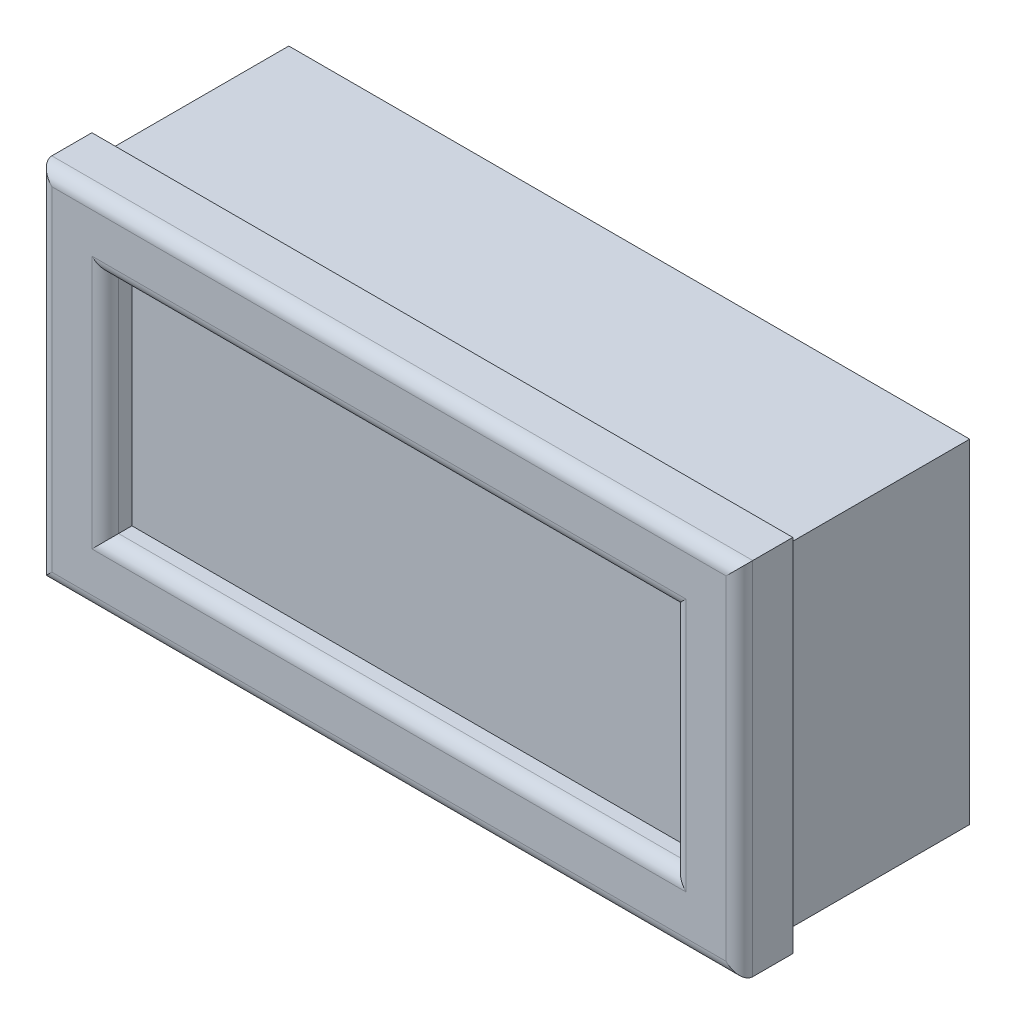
ISO-10303-21;
HEADER;
FILE_DESCRIPTION(('STEP AP214'),'2;1');
FILE_NAME('part.step','',(''),(''),'','','');
FILE_SCHEMA(('AUTOMOTIVE_DESIGN { 1 0 10303 214 1 1 1 1 }'));
ENDSEC;
DATA;
#1=APPLICATION_CONTEXT('core data for automotive mechanical design processes');
#2=APPLICATION_PROTOCOL_DEFINITION('international standard','automotive_design',2000,#1);
#3=PRODUCT_CONTEXT('',#1,'mechanical');
#4=PRODUCT('Part','Part','',(#3));
#5=PRODUCT_RELATED_PRODUCT_CATEGORY('part','',(#4));
#6=PRODUCT_DEFINITION_FORMATION('','',#4);
#7=PRODUCT_DEFINITION_CONTEXT('part definition',#1,'design');
#8=PRODUCT_DEFINITION('design','',#6,#7);
#9=PRODUCT_DEFINITION_SHAPE('','',#8);
#10=(LENGTH_UNIT() NAMED_UNIT(*) SI_UNIT(.MILLI.,.METRE.));
#11=(NAMED_UNIT(*) PLANE_ANGLE_UNIT() SI_UNIT($,.RADIAN.));
#12=(NAMED_UNIT(*) SI_UNIT($,.STERADIAN.) SOLID_ANGLE_UNIT());
#13=UNCERTAINTY_MEASURE_WITH_UNIT(LENGTH_MEASURE(1.E-05),#10,'distance_accuracy_value','');
#14=(GEOMETRIC_REPRESENTATION_CONTEXT(3) GLOBAL_UNCERTAINTY_ASSIGNED_CONTEXT((#13)) GLOBAL_UNIT_ASSIGNED_CONTEXT((#10,
#11,#12)) REPRESENTATION_CONTEXT('',''));
#15=CARTESIAN_POINT('',(0.,0.,0.));
#16=DIRECTION('',(0.,0.,1.));
#17=DIRECTION('',(1.,0.,0.));
#18=AXIS2_PLACEMENT_3D('',#15,#16,#17);
#19=CARTESIAN_POINT('',(0.,0.,-14.));
#20=DIRECTION('',(0.,0.,-1.));
#21=DIRECTION('',(-1.,0.,0.));
#22=AXIS2_PLACEMENT_3D('',#19,#20,#21);
#23=PLANE('',#22);
#24=CARTESIAN_POINT('',(-5.46157800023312,4.59595791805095,-14.));
#25=DIRECTION('',(0.,0.,-1.));
#26=DIRECTION('',(-1.,0.,0.));
#27=AXIS2_PLACEMENT_3D('',#24,#25,#26);
#28=CIRCLE('',#27,1.5);
#29=CARTESIAN_POINT('',(-6.96157800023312,4.59595791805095,-14.));
#30=VERTEX_POINT('',#29);
#31=EDGE_CURVE('E527',#30,#30,#28,.T.);
#32=ORIENTED_EDGE('',*,*,#31,.F.);
#33=EDGE_LOOP('',(#32));
#34=FACE_BOUND('',#33,.T.);
#35=DIRECTION('',(0.,-1.,0.));
#36=VECTOR('',#35,1.);
#37=CARTESIAN_POINT('',(28.5384219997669,10.5959579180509,-14.));
#38=LINE('',#37,#36);
#39=CARTESIAN_POINT('',(28.5384219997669,10.5959579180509,-14.));
#40=VERTEX_POINT('',#39);
#41=CARTESIAN_POINT('',(28.5384219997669,-14.4040420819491,-14.));
#42=VERTEX_POINT('',#41);
#43=EDGE_CURVE('E163',#40,#42,#38,.T.);
#44=ORIENTED_EDGE('',*,*,#43,.T.);
#45=DIRECTION('',(-1.,0.,0.));
#46=VECTOR('',#45,1.);
#47=CARTESIAN_POINT('',(28.5384219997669,-14.4040420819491,-14.));
#48=LINE('',#47,#46);
#49=CARTESIAN_POINT('',(-22.4615780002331,-14.4040420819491,-14.));
#50=VERTEX_POINT('',#49);
#51=EDGE_CURVE('E151',#42,#50,#48,.T.);
#52=ORIENTED_EDGE('',*,*,#51,.T.);
#53=DIRECTION('',(0.,1.,0.));
#54=VECTOR('',#53,1.);
#55=CARTESIAN_POINT('',(-22.4615780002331,10.5959579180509,-14.));
#56=LINE('',#55,#54);
#57=CARTESIAN_POINT('',(-22.4615780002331,10.5959579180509,-14.));
#58=VERTEX_POINT('',#57);
#59=EDGE_CURVE('E162',#50,#58,#56,.T.);
#60=ORIENTED_EDGE('',*,*,#59,.T.);
#61=DIRECTION('',(1.,0.,0.));
#62=VECTOR('',#61,1.);
#63=CARTESIAN_POINT('',(28.5384219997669,10.5959579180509,-14.));
#64=LINE('',#63,#62);
#65=EDGE_CURVE('E168',#58,#40,#64,.T.);
#66=ORIENTED_EDGE('',*,*,#65,.T.);
#67=EDGE_LOOP('',(#44,#52,#60,#66));
#68=FACE_BOUND('',#67,.T.);
#69=CARTESIAN_POINT('',(-12.4615780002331,4.59595791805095,-14.));
#70=DIRECTION('',(0.,0.,-1.));
#71=DIRECTION('',(-1.,0.,0.));
#72=AXIS2_PLACEMENT_3D('',#69,#70,#71);
#73=CIRCLE('',#72,1.5);
#74=CARTESIAN_POINT('',(-13.9615780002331,4.59595791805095,-14.));
#75=VERTEX_POINT('',#74);
#76=EDGE_CURVE('E525',#75,#75,#73,.T.);
#77=ORIENTED_EDGE('',*,*,#76,.F.);
#78=EDGE_LOOP('',(#77));
#79=FACE_BOUND('',#78,.T.);
#80=ADVANCED_FACE('F37',(#34,#68,#79),#23,.T.);
#81=CARTESIAN_POINT('',(0.,0.,0.));
#82=DIRECTION('',(0.,0.,1.));
#83=DIRECTION('',(1.,0.,0.));
#84=AXIS2_PLACEMENT_3D('',#81,#82,#83);
#85=PLANE('',#84);
#86=DIRECTION('',(0.,-1.,0.));
#87=VECTOR('',#86,1.);
#88=CARTESIAN_POINT('',(-23.2115780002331,11.5959579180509,0.));
#89=LINE('',#88,#87);
#90=CARTESIAN_POINT('',(-23.2115780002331,11.5959579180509,0.));
#91=VERTEX_POINT('',#90);
#92=CARTESIAN_POINT('',(-23.2115780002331,-15.4040420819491,0.));
#93=VERTEX_POINT('',#92);
#94=EDGE_CURVE('E196',#91,#93,#89,.T.);
#95=ORIENTED_EDGE('',*,*,#94,.F.);
#96=DIRECTION('',(-1.,0.,0.));
#97=VECTOR('',#96,1.);
#98=CARTESIAN_POINT('',(-23.2115780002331,11.5959579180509,0.));
#99=LINE('',#98,#97);
#100=CARTESIAN_POINT('',(29.2884219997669,11.5959579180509,0.));
#101=VERTEX_POINT('',#100);
#102=EDGE_CURVE('E211',#101,#91,#99,.T.);
#103=ORIENTED_EDGE('',*,*,#102,.F.);
#104=DIRECTION('',(0.,1.,0.));
#105=VECTOR('',#104,1.);
#106=CARTESIAN_POINT('',(29.2884219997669,11.5959579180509,0.));
#107=LINE('',#106,#105);
#108=CARTESIAN_POINT('',(29.2884219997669,-15.4040420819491,0.));
#109=VERTEX_POINT('',#108);
#110=EDGE_CURVE('E208',#109,#101,#107,.T.);
#111=ORIENTED_EDGE('',*,*,#110,.F.);
#112=DIRECTION('',(1.,0.,0.));
#113=VECTOR('',#112,1.);
#114=CARTESIAN_POINT('',(-23.2115780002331,-15.4040420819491,0.));
#115=LINE('',#114,#113);
#116=EDGE_CURVE('E205',#93,#109,#115,.T.);
#117=ORIENTED_EDGE('',*,*,#116,.F.);
#118=EDGE_LOOP('',(#95,#103,#111,#117));
#119=FACE_BOUND('',#118,.T.);
#120=DIRECTION('',(0.,-1.,0.));
#121=VECTOR('',#120,1.);
#122=CARTESIAN_POINT('',(28.5384219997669,10.5959579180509,0.));
#123=LINE('',#122,#121);
#124=CARTESIAN_POINT('',(28.5384219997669,10.5959579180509,0.));
#125=VERTEX_POINT('',#124);
#126=CARTESIAN_POINT('',(28.5384219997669,-14.4040420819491,0.));
#127=VERTEX_POINT('',#126);
#128=EDGE_CURVE('E175',#125,#127,#123,.T.);
#129=ORIENTED_EDGE('',*,*,#128,.F.);
#130=DIRECTION('',(1.,0.,0.));
#131=VECTOR('',#130,1.);
#132=CARTESIAN_POINT('',(28.5384219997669,10.5959579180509,0.));
#133=LINE('',#132,#131);
#134=CARTESIAN_POINT('',(-22.4615780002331,10.5959579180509,0.));
#135=VERTEX_POINT('',#134);
#136=EDGE_CURVE('E172',#135,#125,#133,.T.);
#137=ORIENTED_EDGE('',*,*,#136,.F.);
#138=DIRECTION('',(0.,1.,0.));
#139=VECTOR('',#138,1.);
#140=CARTESIAN_POINT('',(-22.4615780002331,10.5959579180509,0.));
#141=LINE('',#140,#139);
#142=CARTESIAN_POINT('',(-22.4615780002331,-14.4040420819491,0.));
#143=VERTEX_POINT('',#142);
#144=EDGE_CURVE('E540',#143,#135,#141,.T.);
#145=ORIENTED_EDGE('',*,*,#144,.F.);
#146=DIRECTION('',(-1.,0.,0.));
#147=VECTOR('',#146,1.);
#148=CARTESIAN_POINT('',(28.5384219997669,-14.4040420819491,0.));
#149=LINE('',#148,#147);
#150=EDGE_CURVE('E538',#127,#143,#149,.T.);
#151=ORIENTED_EDGE('',*,*,#150,.F.);
#152=EDGE_LOOP('',(#129,#137,#145,#151));
#153=FACE_BOUND('',#152,.T.);
#154=ADVANCED_FACE('F312',(#119,#153),#85,.F.);
#155=CARTESIAN_POINT('',(-23.2115780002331,11.5959579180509,4.));
#156=DIRECTION('',(1.,0.,0.));
#157=DIRECTION('',(0.,1.,0.));
#158=AXIS2_PLACEMENT_3D('',#155,#156,#157);
#159=PLANE('',#158);
#160=DIRECTION('',(0.,0.,-1.));
#161=VECTOR('',#160,1.);
#162=CARTESIAN_POINT('',(-23.2115780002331,-15.4040420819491,4.));
#163=LINE('',#162,#161);
#164=CARTESIAN_POINT('',(-23.2115780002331,-15.4040420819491,3.));
#165=VERTEX_POINT('',#164);
#166=EDGE_CURVE('E220',#165,#93,#163,.T.);
#167=ORIENTED_EDGE('',*,*,#166,.F.);
#168=DIRECTION('',(0.,-1.,0.));
#169=VECTOR('',#168,1.);
#170=CARTESIAN_POINT('',(-23.2115780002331,11.5959579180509,3.));
#171=LINE('',#170,#169);
#172=CARTESIAN_POINT('',(-23.2115780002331,11.5959579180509,3.));
#173=VERTEX_POINT('',#172);
#174=EDGE_CURVE('E247',#165,#173,#171,.F.);
#175=ORIENTED_EDGE('',*,*,#174,.T.);
#176=DIRECTION('',(0.,0.,-1.));
#177=VECTOR('',#176,1.);
#178=CARTESIAN_POINT('',(-23.2115780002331,11.5959579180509,4.));
#179=LINE('',#178,#177);
#180=EDGE_CURVE('E214',#173,#91,#179,.T.);
#181=ORIENTED_EDGE('',*,*,#180,.T.);
#182=ORIENTED_EDGE('',*,*,#94,.T.);
#183=EDGE_LOOP('',(#167,#175,#181,#182));
#184=FACE_BOUND('',#183,.T.);
#185=ADVANCED_FACE('F320',(#184),#159,.F.);
#186=CARTESIAN_POINT('',(-23.2115780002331,-15.4040420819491,4.));
#187=DIRECTION('',(0.,1.,0.));
#188=DIRECTION('',(0.,0.,1.));
#189=AXIS2_PLACEMENT_3D('',#186,#187,#188);
#190=PLANE('',#189);
#191=DIRECTION('',(0.,0.,-1.));
#192=VECTOR('',#191,1.);
#193=CARTESIAN_POINT('',(29.2884219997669,-15.4040420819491,4.));
#194=LINE('',#193,#192);
#195=CARTESIAN_POINT('',(29.2884219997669,-15.4040420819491,3.));
#196=VERTEX_POINT('',#195);
#197=EDGE_CURVE('E218',#196,#109,#194,.T.);
#198=ORIENTED_EDGE('',*,*,#197,.F.);
#199=DIRECTION('',(1.,0.,0.));
#200=VECTOR('',#199,1.);
#201=CARTESIAN_POINT('',(-23.2115780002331,-15.4040420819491,3.));
#202=LINE('',#201,#200);
#203=EDGE_CURVE('E245',#196,#165,#202,.F.);
#204=ORIENTED_EDGE('',*,*,#203,.T.);
#205=ORIENTED_EDGE('',*,*,#166,.T.);
#206=ORIENTED_EDGE('',*,*,#116,.T.);
#207=EDGE_LOOP('',(#198,#204,#205,#206));
#208=FACE_BOUND('',#207,.T.);
#209=ADVANCED_FACE('F358',(#208),#190,.F.);
#210=CARTESIAN_POINT('',(29.2884219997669,11.5959579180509,4.));
#211=DIRECTION('',(-1.,0.,0.));
#212=DIRECTION('',(0.,-1.,0.));
#213=AXIS2_PLACEMENT_3D('',#210,#211,#212);
#214=PLANE('',#213);
#215=DIRECTION('',(0.,0.,-1.));
#216=VECTOR('',#215,1.);
#217=CARTESIAN_POINT('',(29.2884219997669,11.5959579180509,4.));
#218=LINE('',#217,#216);
#219=CARTESIAN_POINT('',(29.2884219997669,11.5959579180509,3.));
#220=VERTEX_POINT('',#219);
#221=EDGE_CURVE('E216',#220,#101,#218,.T.);
#222=ORIENTED_EDGE('',*,*,#221,.F.);
#223=DIRECTION('',(0.,1.,0.));
#224=VECTOR('',#223,1.);
#225=CARTESIAN_POINT('',(29.2884219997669,-15.4040420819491,3.));
#226=LINE('',#225,#224);
#227=EDGE_CURVE('E243',#220,#196,#226,.F.);
#228=ORIENTED_EDGE('',*,*,#227,.T.);
#229=ORIENTED_EDGE('',*,*,#197,.T.);
#230=ORIENTED_EDGE('',*,*,#110,.T.);
#231=EDGE_LOOP('',(#222,#228,#229,#230));
#232=FACE_BOUND('',#231,.T.);
#233=ADVANCED_FACE('F354',(#232),#214,.F.);
#234=CARTESIAN_POINT('',(-23.2115780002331,11.5959579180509,4.));
#235=DIRECTION('',(0.,-1.,0.));
#236=DIRECTION('',(0.,0.,-1.));
#237=AXIS2_PLACEMENT_3D('',#234,#235,#236);
#238=PLANE('',#237);
#239=ORIENTED_EDGE('',*,*,#180,.F.);
#240=DIRECTION('',(-1.,0.,0.));
#241=VECTOR('',#240,1.);
#242=CARTESIAN_POINT('',(29.2884219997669,11.5959579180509,3.));
#243=LINE('',#242,#241);
#244=EDGE_CURVE('E240',#173,#220,#243,.F.);
#245=ORIENTED_EDGE('',*,*,#244,.T.);
#246=ORIENTED_EDGE('',*,*,#221,.T.);
#247=ORIENTED_EDGE('',*,*,#102,.T.);
#248=EDGE_LOOP('',(#239,#245,#246,#247));
#249=FACE_BOUND('',#248,.T.);
#250=ADVANCED_FACE('F349',(#249),#238,.F.);
#251=CARTESIAN_POINT('',(0.,0.,4.));
#252=DIRECTION('',(0.,0.,1.));
#253=DIRECTION('',(1.,0.,0.));
#254=AXIS2_PLACEMENT_3D('',#251,#252,#253);
#255=PLANE('',#254);
#256=DIRECTION('',(0.,1.,0.));
#257=VECTOR('',#256,1.);
#258=CARTESIAN_POINT('',(28.2884219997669,11.5959579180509,4.));
#259=LINE('',#258,#257);
#260=CARTESIAN_POINT('',(28.2884219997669,-14.4040420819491,4.));
#261=VERTEX_POINT('',#260);
#262=CARTESIAN_POINT('',(28.2884219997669,10.5959579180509,4.));
#263=VERTEX_POINT('',#262);
#264=EDGE_CURVE('E235',#261,#263,#259,.T.);
#265=ORIENTED_EDGE('',*,*,#264,.T.);
#266=DIRECTION('',(-1.,0.,0.));
#267=VECTOR('',#266,1.);
#268=CARTESIAN_POINT('',(-23.2115780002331,10.5959579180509,4.));
#269=LINE('',#268,#267);
#270=CARTESIAN_POINT('',(-22.2115780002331,10.5959579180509,4.));
#271=VERTEX_POINT('',#270);
#272=EDGE_CURVE('E237',#263,#271,#269,.T.);
#273=ORIENTED_EDGE('',*,*,#272,.T.);
#274=DIRECTION('',(0.,-1.,0.));
#275=VECTOR('',#274,1.);
#276=CARTESIAN_POINT('',(-22.2115780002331,-15.4040420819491,4.));
#277=LINE('',#276,#275);
#278=CARTESIAN_POINT('',(-22.2115780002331,-14.4040420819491,4.));
#279=VERTEX_POINT('',#278);
#280=EDGE_CURVE('E231',#271,#279,#277,.T.);
#281=ORIENTED_EDGE('',*,*,#280,.T.);
#282=DIRECTION('',(1.,0.,0.));
#283=VECTOR('',#282,1.);
#284=CARTESIAN_POINT('',(29.2884219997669,-14.4040420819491,4.));
#285=LINE('',#284,#283);
#286=EDGE_CURVE('E233',#279,#261,#285,.T.);
#287=ORIENTED_EDGE('',*,*,#286,.T.);
#288=EDGE_LOOP('',(#265,#273,#281,#287));
#289=FACE_BOUND('',#288,.T.);
#290=DIRECTION('',(0.,1.,0.));
#291=VECTOR('',#290,1.);
#292=CARTESIAN_POINT('',(25.2884219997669,-10.4040420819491,4.));
#293=LINE('',#292,#291);
#294=CARTESIAN_POINT('',(25.2884219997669,7.59595791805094,4.));
#295=VERTEX_POINT('',#294);
#296=CARTESIAN_POINT('',(25.2884219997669,-11.4040420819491,4.));
#297=VERTEX_POINT('',#296);
#298=EDGE_CURVE('E226',#295,#297,#293,.F.);
#299=ORIENTED_EDGE('',*,*,#298,.T.);
#300=DIRECTION('',(1.,0.,0.));
#301=VECTOR('',#300,1.);
#302=CARTESIAN_POINT('',(-18.2115780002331,-11.4040420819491,4.));
#303=LINE('',#302,#301);
#304=CARTESIAN_POINT('',(-19.2115780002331,-11.4040420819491,4.));
#305=VERTEX_POINT('',#304);
#306=EDGE_CURVE('E228',#297,#305,#303,.F.);
#307=ORIENTED_EDGE('',*,*,#306,.T.);
#308=DIRECTION('',(0.,-1.,0.));
#309=VECTOR('',#308,1.);
#310=CARTESIAN_POINT('',(-19.2115780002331,6.59595791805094,4.));
#311=LINE('',#310,#309);
#312=CARTESIAN_POINT('',(-19.2115780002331,7.59595791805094,4.));
#313=VERTEX_POINT('',#312);
#314=EDGE_CURVE('E222',#305,#313,#311,.F.);
#315=ORIENTED_EDGE('',*,*,#314,.T.);
#316=DIRECTION('',(-1.,0.,0.));
#317=VECTOR('',#316,1.);
#318=CARTESIAN_POINT('',(24.2884219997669,7.59595791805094,4.));
#319=LINE('',#318,#317);
#320=EDGE_CURVE('E224',#313,#295,#319,.F.);
#321=ORIENTED_EDGE('',*,*,#320,.T.);
#322=EDGE_LOOP('',(#299,#307,#315,#321));
#323=FACE_BOUND('',#322,.T.);
#324=ADVANCED_FACE('F283',(#289,#323),#255,.T.);
#325=CARTESIAN_POINT('',(-18.2115780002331,6.59595791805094,2.));
#326=DIRECTION('',(-1.,0.,0.));
#327=DIRECTION('',(0.,-1.,0.));
#328=AXIS2_PLACEMENT_3D('',#325,#326,#327);
#329=PLANE('',#328);
#330=DIRECTION('',(0.,0.,1.));
#331=VECTOR('',#330,1.);
#332=CARTESIAN_POINT('',(-18.2115780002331,6.59595791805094,2.));
#333=LINE('',#332,#331);
#334=CARTESIAN_POINT('',(-18.2115780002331,6.59595791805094,2.));
#335=VERTEX_POINT('',#334);
#336=CARTESIAN_POINT('',(-18.2115780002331,6.59595791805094,3.));
#337=VERTEX_POINT('',#336);
#338=EDGE_CURVE('E194',#335,#337,#333,.T.);
#339=ORIENTED_EDGE('',*,*,#338,.T.);
#340=DIRECTION('',(0.,-1.,0.));
#341=VECTOR('',#340,1.);
#342=CARTESIAN_POINT('',(-18.2115780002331,-10.4040420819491,3.));
#343=LINE('',#342,#341);
#344=CARTESIAN_POINT('',(-18.2115780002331,-10.4040420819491,3.));
#345=VERTEX_POINT('',#344);
#346=EDGE_CURVE('E11',#337,#345,#343,.T.);
#347=ORIENTED_EDGE('',*,*,#346,.T.);
#348=DIRECTION('',(0.,0.,1.));
#349=VECTOR('',#348,1.);
#350=CARTESIAN_POINT('',(-18.2115780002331,-10.4040420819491,2.));
#351=LINE('',#350,#349);
#352=CARTESIAN_POINT('',(-18.2115780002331,-10.4040420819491,2.));
#353=VERTEX_POINT('',#352);
#354=EDGE_CURVE('E193',#353,#345,#351,.T.);
#355=ORIENTED_EDGE('',*,*,#354,.F.);
#356=DIRECTION('',(0.,-1.,0.));
#357=VECTOR('',#356,1.);
#358=CARTESIAN_POINT('',(-18.2115780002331,6.59595791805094,2.));
#359=LINE('',#358,#357);
#360=EDGE_CURVE('E176',#335,#353,#359,.T.);
#361=ORIENTED_EDGE('',*,*,#360,.F.);
#362=EDGE_LOOP('',(#339,#347,#355,#361));
#363=FACE_BOUND('',#362,.T.);
#364=ADVANCED_FACE('F300',(#363),#329,.F.);
#365=CARTESIAN_POINT('',(-18.2115780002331,6.59595791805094,2.));
#366=DIRECTION('',(0.,1.,0.));
#367=DIRECTION('',(0.,0.,1.));
#368=AXIS2_PLACEMENT_3D('',#365,#366,#367);
#369=PLANE('',#368);
#370=DIRECTION('',(0.,0.,1.));
#371=VECTOR('',#370,1.);
#372=CARTESIAN_POINT('',(24.2884219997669,6.59595791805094,2.));
#373=LINE('',#372,#371);
#374=CARTESIAN_POINT('',(24.2884219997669,6.59595791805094,2.));
#375=VERTEX_POINT('',#374);
#376=CARTESIAN_POINT('',(24.2884219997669,6.59595791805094,3.));
#377=VERTEX_POINT('',#376);
#378=EDGE_CURVE('E197',#375,#377,#373,.T.);
#379=ORIENTED_EDGE('',*,*,#378,.T.);
#380=DIRECTION('',(-1.,0.,0.));
#381=VECTOR('',#380,1.);
#382=CARTESIAN_POINT('',(-18.2115780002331,6.59595791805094,3.));
#383=LINE('',#382,#381);
#384=EDGE_CURVE('E46',#377,#337,#383,.T.);
#385=ORIENTED_EDGE('',*,*,#384,.T.);
#386=ORIENTED_EDGE('',*,*,#338,.F.);
#387=DIRECTION('',(-1.,0.,0.));
#388=VECTOR('',#387,1.);
#389=CARTESIAN_POINT('',(-18.2115780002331,6.59595791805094,2.));
#390=LINE('',#389,#388);
#391=EDGE_CURVE('E190',#375,#335,#390,.T.);
#392=ORIENTED_EDGE('',*,*,#391,.F.);
#393=EDGE_LOOP('',(#379,#385,#386,#392));
#394=FACE_BOUND('',#393,.T.);
#395=ADVANCED_FACE('F301',(#394),#369,.F.);
#396=CARTESIAN_POINT('',(24.2884219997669,6.59595791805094,2.));
#397=DIRECTION('',(1.,0.,0.));
#398=DIRECTION('',(0.,1.,0.));
#399=AXIS2_PLACEMENT_3D('',#396,#397,#398);
#400=PLANE('',#399);
#401=DIRECTION('',(0.,0.,1.));
#402=VECTOR('',#401,1.);
#403=CARTESIAN_POINT('',(24.2884219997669,-10.4040420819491,2.));
#404=LINE('',#403,#402);
#405=CARTESIAN_POINT('',(24.2884219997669,-10.4040420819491,2.));
#406=VERTEX_POINT('',#405);
#407=CARTESIAN_POINT('',(24.2884219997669,-10.4040420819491,3.));
#408=VERTEX_POINT('',#407);
#409=EDGE_CURVE('E199',#406,#408,#404,.T.);
#410=ORIENTED_EDGE('',*,*,#409,.T.);
#411=DIRECTION('',(0.,1.,0.));
#412=VECTOR('',#411,1.);
#413=CARTESIAN_POINT('',(24.2884219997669,6.59595791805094,3.));
#414=LINE('',#413,#412);
#415=EDGE_CURVE('E61',#408,#377,#414,.T.);
#416=ORIENTED_EDGE('',*,*,#415,.T.);
#417=ORIENTED_EDGE('',*,*,#378,.F.);
#418=DIRECTION('',(0.,1.,0.));
#419=VECTOR('',#418,1.);
#420=CARTESIAN_POINT('',(24.2884219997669,6.59595791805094,2.));
#421=LINE('',#420,#419);
#422=EDGE_CURVE('E187',#406,#375,#421,.T.);
#423=ORIENTED_EDGE('',*,*,#422,.F.);
#424=EDGE_LOOP('',(#410,#416,#417,#423));
#425=FACE_BOUND('',#424,.T.);
#426=ADVANCED_FACE('F294',(#425),#400,.F.);
#427=CARTESIAN_POINT('',(-18.2115780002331,-10.4040420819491,2.));
#428=DIRECTION('',(0.,-1.,0.));
#429=DIRECTION('',(0.,0.,-1.));
#430=AXIS2_PLACEMENT_3D('',#427,#428,#429);
#431=PLANE('',#430);
#432=ORIENTED_EDGE('',*,*,#354,.T.);
#433=DIRECTION('',(1.,0.,0.));
#434=VECTOR('',#433,1.);
#435=CARTESIAN_POINT('',(24.2884219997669,-10.4040420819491,3.));
#436=LINE('',#435,#434);
#437=EDGE_CURVE('E249',#345,#408,#436,.T.);
#438=ORIENTED_EDGE('',*,*,#437,.T.);
#439=ORIENTED_EDGE('',*,*,#409,.F.);
#440=DIRECTION('',(1.,0.,0.));
#441=VECTOR('',#440,1.);
#442=CARTESIAN_POINT('',(-18.2115780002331,-10.4040420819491,2.));
#443=LINE('',#442,#441);
#444=EDGE_CURVE('E179',#353,#406,#443,.T.);
#445=ORIENTED_EDGE('',*,*,#444,.F.);
#446=EDGE_LOOP('',(#432,#438,#439,#445));
#447=FACE_BOUND('',#446,.T.);
#448=ADVANCED_FACE('F291',(#447),#431,.F.);
#449=CARTESIAN_POINT('',(0.,0.,2.));
#450=DIRECTION('',(0.,0.,1.));
#451=DIRECTION('',(1.,0.,0.));
#452=AXIS2_PLACEMENT_3D('',#449,#450,#451);
#453=PLANE('',#452);
#454=ORIENTED_EDGE('',*,*,#360,.T.);
#455=ORIENTED_EDGE('',*,*,#444,.T.);
#456=ORIENTED_EDGE('',*,*,#422,.T.);
#457=ORIENTED_EDGE('',*,*,#391,.T.);
#458=EDGE_LOOP('',(#454,#455,#456,#457));
#459=FACE_BOUND('',#458,.T.);
#460=ADVANCED_FACE('F297',(#459),#453,.T.);
#461=CARTESIAN_POINT('',(28.5384219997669,10.5959579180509,-14.));
#462=DIRECTION('',(-1.,0.,0.));
#463=DIRECTION('',(0.,-1.,0.));
#464=AXIS2_PLACEMENT_3D('',#461,#462,#463);
#465=PLANE('',#464);
#466=ORIENTED_EDGE('',*,*,#128,.T.);
#467=DIRECTION('',(0.,0.,1.));
#468=VECTOR('',#467,1.);
#469=CARTESIAN_POINT('',(28.5384219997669,-14.4040420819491,-14.));
#470=LINE('',#469,#468);
#471=EDGE_CURVE('E156',#42,#127,#470,.T.);
#472=ORIENTED_EDGE('',*,*,#471,.F.);
#473=ORIENTED_EDGE('',*,*,#43,.F.);
#474=DIRECTION('',(0.,0.,1.));
#475=VECTOR('',#474,1.);
#476=CARTESIAN_POINT('',(28.5384219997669,10.5959579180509,-14.));
#477=LINE('',#476,#475);
#478=EDGE_CURVE('E536',#40,#125,#477,.T.);
#479=ORIENTED_EDGE('',*,*,#478,.T.);
#480=EDGE_LOOP('',(#466,#472,#473,#479));
#481=FACE_BOUND('',#480,.T.);
#482=ADVANCED_FACE('F174',(#481),#465,.F.);
#483=CARTESIAN_POINT('',(28.5384219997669,-14.4040420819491,-14.));
#484=DIRECTION('',(0.,1.,0.));
#485=DIRECTION('',(0.,0.,1.));
#486=AXIS2_PLACEMENT_3D('',#483,#484,#485);
#487=PLANE('',#486);
#488=ORIENTED_EDGE('',*,*,#150,.T.);
#489=DIRECTION('',(0.,0.,1.));
#490=VECTOR('',#489,1.);
#491=CARTESIAN_POINT('',(-22.4615780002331,-14.4040420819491,-14.));
#492=LINE('',#491,#490);
#493=EDGE_CURVE('E159',#50,#143,#492,.T.);
#494=ORIENTED_EDGE('',*,*,#493,.F.);
#495=ORIENTED_EDGE('',*,*,#51,.F.);
#496=ORIENTED_EDGE('',*,*,#471,.T.);
#497=EDGE_LOOP('',(#488,#494,#495,#496));
#498=FACE_BOUND('',#497,.T.);
#499=ADVANCED_FACE('F154',(#498),#487,.F.);
#500=CARTESIAN_POINT('',(-22.4615780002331,10.5959579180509,-14.));
#501=DIRECTION('',(1.,0.,0.));
#502=DIRECTION('',(0.,0.,-1.));
#503=AXIS2_PLACEMENT_3D('',#500,#501,#502);
#504=PLANE('',#503);
#505=ORIENTED_EDGE('',*,*,#144,.T.);
#506=DIRECTION('',(0.,0.,1.));
#507=VECTOR('',#506,1.);
#508=CARTESIAN_POINT('',(-22.4615780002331,10.5959579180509,-14.));
#509=LINE('',#508,#507);
#510=EDGE_CURVE('E181',#58,#135,#509,.T.);
#511=ORIENTED_EDGE('',*,*,#510,.F.);
#512=ORIENTED_EDGE('',*,*,#59,.F.);
#513=ORIENTED_EDGE('',*,*,#493,.T.);
#514=EDGE_LOOP('',(#505,#511,#512,#513));
#515=FACE_BOUND('',#514,.T.);
#516=ADVANCED_FACE('F332',(#515),#504,.F.);
#517=CARTESIAN_POINT('',(28.5384219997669,10.5959579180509,-14.));
#518=DIRECTION('',(0.,-1.,0.));
#519=DIRECTION('',(0.,0.,-1.));
#520=AXIS2_PLACEMENT_3D('',#517,#518,#519);
#521=PLANE('',#520);
#522=ORIENTED_EDGE('',*,*,#136,.T.);
#523=ORIENTED_EDGE('',*,*,#478,.F.);
#524=ORIENTED_EDGE('',*,*,#65,.F.);
#525=ORIENTED_EDGE('',*,*,#510,.T.);
#526=EDGE_LOOP('',(#522,#523,#524,#525));
#527=FACE_BOUND('',#526,.T.);
#528=ADVANCED_FACE('F328',(#527),#521,.F.);
#529=CARTESIAN_POINT('',(0.,-14.4040420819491,3.));
#530=DIRECTION('',(-1.,0.,0.));
#531=DIRECTION('',(0.,0.,1.));
#532=AXIS2_PLACEMENT_3D('',#529,#530,#531);
#533=CYLINDRICAL_SURFACE('',#532,1.);
#534=CARTESIAN_POINT('',(-22.2115780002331,-14.4040420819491,3.));
#535=DIRECTION('',(-0.707106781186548,0.707106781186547,0.));
#536=DIRECTION('',(0.707106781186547,0.707106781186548,0.));
#537=AXIS2_PLACEMENT_3D('',#534,#535,#536);
#538=ELLIPSE('',#537,1.41421356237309,1.);
#539=EDGE_CURVE('E258',#165,#279,#538,.T.);
#540=ORIENTED_EDGE('',*,*,#539,.F.);
#541=ORIENTED_EDGE('',*,*,#203,.F.);
#542=CARTESIAN_POINT('',(28.2884219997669,-14.4040420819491,3.));
#543=DIRECTION('',(-0.707106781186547,-0.707106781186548,0.));
#544=DIRECTION('',(-0.707106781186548,0.707106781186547,0.));
#545=AXIS2_PLACEMENT_3D('',#542,#543,#544);
#546=ELLIPSE('',#545,1.4142135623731,1.);
#547=EDGE_CURVE('E261',#261,#196,#546,.F.);
#548=ORIENTED_EDGE('',*,*,#547,.F.);
#549=ORIENTED_EDGE('',*,*,#286,.F.);
#550=EDGE_LOOP('',(#540,#541,#548,#549));
#551=FACE_BOUND('',#550,.T.);
#552=ADVANCED_FACE('F331',(#551),#533,.T.);
#553=CARTESIAN_POINT('',(28.2884219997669,0.,3.));
#554=DIRECTION('',(0.,-1.,0.));
#555=DIRECTION('',(1.,0.,0.));
#556=AXIS2_PLACEMENT_3D('',#553,#554,#555);
#557=CYLINDRICAL_SURFACE('',#556,1.);
#558=ORIENTED_EDGE('',*,*,#547,.T.);
#559=ORIENTED_EDGE('',*,*,#227,.F.);
#560=CARTESIAN_POINT('',(28.2884219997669,10.5959579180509,3.));
#561=DIRECTION('',(0.707106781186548,-0.707106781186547,0.));
#562=DIRECTION('',(-0.707106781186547,-0.707106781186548,0.));
#563=AXIS2_PLACEMENT_3D('',#560,#561,#562);
#564=ELLIPSE('',#563,1.41421356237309,1.);
#565=EDGE_CURVE('E256',#263,#220,#564,.F.);
#566=ORIENTED_EDGE('',*,*,#565,.F.);
#567=ORIENTED_EDGE('',*,*,#264,.F.);
#568=EDGE_LOOP('',(#558,#559,#566,#567));
#569=FACE_BOUND('',#568,.T.);
#570=ADVANCED_FACE('F373',(#569),#557,.T.);
#571=CARTESIAN_POINT('',(-22.2115780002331,0.,3.));
#572=DIRECTION('',(0.,1.,0.));
#573=DIRECTION('',(-1.,0.,0.));
#574=AXIS2_PLACEMENT_3D('',#571,#572,#573);
#575=CYLINDRICAL_SURFACE('',#574,1.);
#576=ORIENTED_EDGE('',*,*,#539,.T.);
#577=ORIENTED_EDGE('',*,*,#280,.F.);
#578=CARTESIAN_POINT('',(-22.2115780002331,10.5959579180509,3.));
#579=DIRECTION('',(0.707106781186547,0.707106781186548,0.));
#580=DIRECTION('',(-0.707106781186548,0.707106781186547,0.));
#581=AXIS2_PLACEMENT_3D('',#578,#579,#580);
#582=ELLIPSE('',#581,1.4142135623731,1.);
#583=EDGE_CURVE('E254',#173,#271,#582,.T.);
#584=ORIENTED_EDGE('',*,*,#583,.F.);
#585=ORIENTED_EDGE('',*,*,#174,.F.);
#586=EDGE_LOOP('',(#576,#577,#584,#585));
#587=FACE_BOUND('',#586,.T.);
#588=ADVANCED_FACE('F369',(#587),#575,.T.);
#589=CARTESIAN_POINT('',(0.,10.5959579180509,3.));
#590=DIRECTION('',(1.,0.,0.));
#591=DIRECTION('',(0.,0.,-1.));
#592=AXIS2_PLACEMENT_3D('',#589,#590,#591);
#593=CYLINDRICAL_SURFACE('',#592,1.);
#594=ORIENTED_EDGE('',*,*,#565,.T.);
#595=ORIENTED_EDGE('',*,*,#244,.F.);
#596=ORIENTED_EDGE('',*,*,#583,.T.);
#597=ORIENTED_EDGE('',*,*,#272,.F.);
#598=EDGE_LOOP('',(#594,#595,#596,#597));
#599=FACE_BOUND('',#598,.T.);
#600=ADVANCED_FACE('F366',(#599),#593,.T.);
#601=CARTESIAN_POINT('',(-18.2115780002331,7.59595791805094,3.));
#602=DIRECTION('',(1.,0.,0.));
#603=DIRECTION('',(0.,0.,-1.));
#604=AXIS2_PLACEMENT_3D('',#601,#602,#603);
#605=CYLINDRICAL_SURFACE('',#604,1.);
#606=CARTESIAN_POINT('',(25.2884219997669,7.59595791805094,3.));
#607=DIRECTION('',(0.707106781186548,-0.707106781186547,0.));
#608=DIRECTION('',(-0.707106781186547,-0.707106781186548,0.));
#609=AXIS2_PLACEMENT_3D('',#606,#607,#608);
#610=ELLIPSE('',#609,1.41421356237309,1.);
#611=EDGE_CURVE('E268',#295,#377,#610,.T.);
#612=ORIENTED_EDGE('',*,*,#611,.F.);
#613=ORIENTED_EDGE('',*,*,#320,.F.);
#614=CARTESIAN_POINT('',(-19.2115780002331,7.59595791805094,3.));
#615=DIRECTION('',(0.707106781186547,0.707106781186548,0.));
#616=DIRECTION('',(0.707106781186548,-0.707106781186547,0.));
#617=AXIS2_PLACEMENT_3D('',#614,#615,#616);
#618=ELLIPSE('',#617,1.4142135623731,1.);
#619=EDGE_CURVE('E41',#337,#313,#618,.F.);
#620=ORIENTED_EDGE('',*,*,#619,.F.);
#621=ORIENTED_EDGE('',*,*,#384,.F.);
#622=EDGE_LOOP('',(#612,#613,#620,#621));
#623=FACE_BOUND('',#622,.T.);
#624=ADVANCED_FACE('F39',(#623),#605,.T.);
#625=CARTESIAN_POINT('',(-19.2115780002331,6.59595791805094,3.));
#626=DIRECTION('',(0.,1.,0.));
#627=DIRECTION('',(-1.,0.,0.));
#628=AXIS2_PLACEMENT_3D('',#625,#626,#627);
#629=CYLINDRICAL_SURFACE('',#628,1.);
#630=ORIENTED_EDGE('',*,*,#619,.T.);
#631=ORIENTED_EDGE('',*,*,#314,.F.);
#632=CARTESIAN_POINT('',(-19.2115780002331,-11.4040420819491,3.));
#633=DIRECTION('',(-0.707106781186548,0.707106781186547,0.));
#634=DIRECTION('',(-0.707106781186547,-0.707106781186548,0.));
#635=AXIS2_PLACEMENT_3D('',#632,#633,#634);
#636=ELLIPSE('',#635,1.41421356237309,1.);
#637=EDGE_CURVE('E266',#345,#305,#636,.F.);
#638=ORIENTED_EDGE('',*,*,#637,.F.);
#639=ORIENTED_EDGE('',*,*,#346,.F.);
#640=EDGE_LOOP('',(#630,#631,#638,#639));
#641=FACE_BOUND('',#640,.T.);
#642=ADVANCED_FACE('F278',(#641),#629,.T.);
#643=CARTESIAN_POINT('',(25.2884219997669,6.59595791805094,3.));
#644=DIRECTION('',(0.,-1.,0.));
#645=DIRECTION('',(1.,0.,0.));
#646=AXIS2_PLACEMENT_3D('',#643,#644,#645);
#647=CYLINDRICAL_SURFACE('',#646,1.);
#648=ORIENTED_EDGE('',*,*,#611,.T.);
#649=ORIENTED_EDGE('',*,*,#415,.F.);
#650=CARTESIAN_POINT('',(25.2884219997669,-11.4040420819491,3.));
#651=DIRECTION('',(-0.707106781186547,-0.707106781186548,0.));
#652=DIRECTION('',(-0.707106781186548,0.707106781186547,0.));
#653=AXIS2_PLACEMENT_3D('',#650,#651,#652);
#654=ELLIPSE('',#653,1.4142135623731,1.);
#655=EDGE_CURVE('E264',#297,#408,#654,.T.);
#656=ORIENTED_EDGE('',*,*,#655,.F.);
#657=ORIENTED_EDGE('',*,*,#298,.F.);
#658=EDGE_LOOP('',(#648,#649,#656,#657));
#659=FACE_BOUND('',#658,.T.);
#660=ADVANCED_FACE('F289',(#659),#647,.T.);
#661=CARTESIAN_POINT('',(-18.2115780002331,-11.4040420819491,3.));
#662=DIRECTION('',(-1.,0.,0.));
#663=DIRECTION('',(0.,0.,1.));
#664=AXIS2_PLACEMENT_3D('',#661,#662,#663);
#665=CYLINDRICAL_SURFACE('',#664,1.);
#666=ORIENTED_EDGE('',*,*,#637,.T.);
#667=ORIENTED_EDGE('',*,*,#306,.F.);
#668=ORIENTED_EDGE('',*,*,#655,.T.);
#669=ORIENTED_EDGE('',*,*,#437,.F.);
#670=EDGE_LOOP('',(#666,#667,#668,#669));
#671=FACE_BOUND('',#670,.T.);
#672=ADVANCED_FACE('F287',(#671),#665,.T.);
#673=CARTESIAN_POINT('',(-5.46157800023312,4.59595791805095,-15.5));
#674=DIRECTION('',(0.,0.,1.));
#675=DIRECTION('',(1.,0.,0.));
#676=AXIS2_PLACEMENT_3D('',#673,#674,#675);
#677=CYLINDRICAL_SURFACE('',#676,1.5);
#678=CARTESIAN_POINT('',(-5.46157800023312,4.59595791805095,-15.5));
#679=DIRECTION('',(0.,0.,-1.));
#680=DIRECTION('',(-1.,0.,0.));
#681=AXIS2_PLACEMENT_3D('',#678,#679,#680);
#682=CIRCLE('',#681,1.5);
#683=CARTESIAN_POINT('',(-6.96157800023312,4.59595791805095,-15.5));
#684=VERTEX_POINT('',#683);
#685=EDGE_CURVE('E267',#684,#684,#682,.T.);
#686=ORIENTED_EDGE('',*,*,#685,.F.);
#687=EDGE_LOOP('',(#686));
#688=FACE_BOUND('',#687,.T.);
#689=ORIENTED_EDGE('',*,*,#31,.T.);
#690=EDGE_LOOP('',(#689));
#691=FACE_BOUND('',#690,.T.);
#692=ADVANCED_FACE('F326',(#688,#691),#677,.T.);
#693=CARTESIAN_POINT('',(-5.46157800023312,4.59595791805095,-15.5));
#694=DIRECTION('',(0.,0.,-1.));
#695=DIRECTION('',(-1.,0.,0.));
#696=AXIS2_PLACEMENT_3D('',#693,#694,#695);
#697=PLANE('',#696);
#698=ORIENTED_EDGE('',*,*,#685,.T.);
#699=EDGE_LOOP('',(#698));
#700=FACE_BOUND('',#699,.T.);
#701=ADVANCED_FACE('F441',(#700),#697,.T.);
#702=CARTESIAN_POINT('',(-12.4615780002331,4.59595791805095,-15.5));
#703=DIRECTION('',(0.,0.,1.));
#704=DIRECTION('',(1.,0.,0.));
#705=AXIS2_PLACEMENT_3D('',#702,#703,#704);
#706=CYLINDRICAL_SURFACE('',#705,1.5);
#707=CARTESIAN_POINT('',(-12.4615780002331,4.59595791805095,-15.5));
#708=DIRECTION('',(0.,0.,-1.));
#709=DIRECTION('',(-1.,0.,0.));
#710=AXIS2_PLACEMENT_3D('',#707,#708,#709);
#711=CIRCLE('',#710,1.5);
#712=CARTESIAN_POINT('',(-13.9615780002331,4.59595791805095,-15.5));
#713=VERTEX_POINT('',#712);
#714=EDGE_CURVE('E522',#713,#713,#711,.T.);
#715=ORIENTED_EDGE('',*,*,#714,.F.);
#716=EDGE_LOOP('',(#715));
#717=FACE_BOUND('',#716,.T.);
#718=ORIENTED_EDGE('',*,*,#76,.T.);
#719=EDGE_LOOP('',(#718));
#720=FACE_BOUND('',#719,.T.);
#721=ADVANCED_FACE('F446',(#717,#720),#706,.T.);
#722=CARTESIAN_POINT('',(-12.4615780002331,4.59595791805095,-15.5));
#723=DIRECTION('',(0.,0.,-1.));
#724=DIRECTION('',(-1.,0.,0.));
#725=AXIS2_PLACEMENT_3D('',#722,#723,#724);
#726=PLANE('',#725);
#727=ORIENTED_EDGE('',*,*,#714,.T.);
#728=EDGE_LOOP('',(#727));
#729=FACE_BOUND('',#728,.T.);
#730=ADVANCED_FACE('F460',(#729),#726,.T.);
#731=CLOSED_SHELL('',(#80,#154,#185,#209,#233,#250,#324,#364,#395,#426,#448,#460,#482,#499,#516,
#528,#552,#570,#588,#600,#624,#642,#660,#672,#692,#701,#721,#730));
#732=MANIFOLD_SOLID_BREP('B2',#731);
#733=ADVANCED_BREP_SHAPE_REPRESENTATION('',(#18,#732),#14);
#734=SHAPE_DEFINITION_REPRESENTATION(#9,#733);
ENDSEC;
END-ISO-10303-21;
